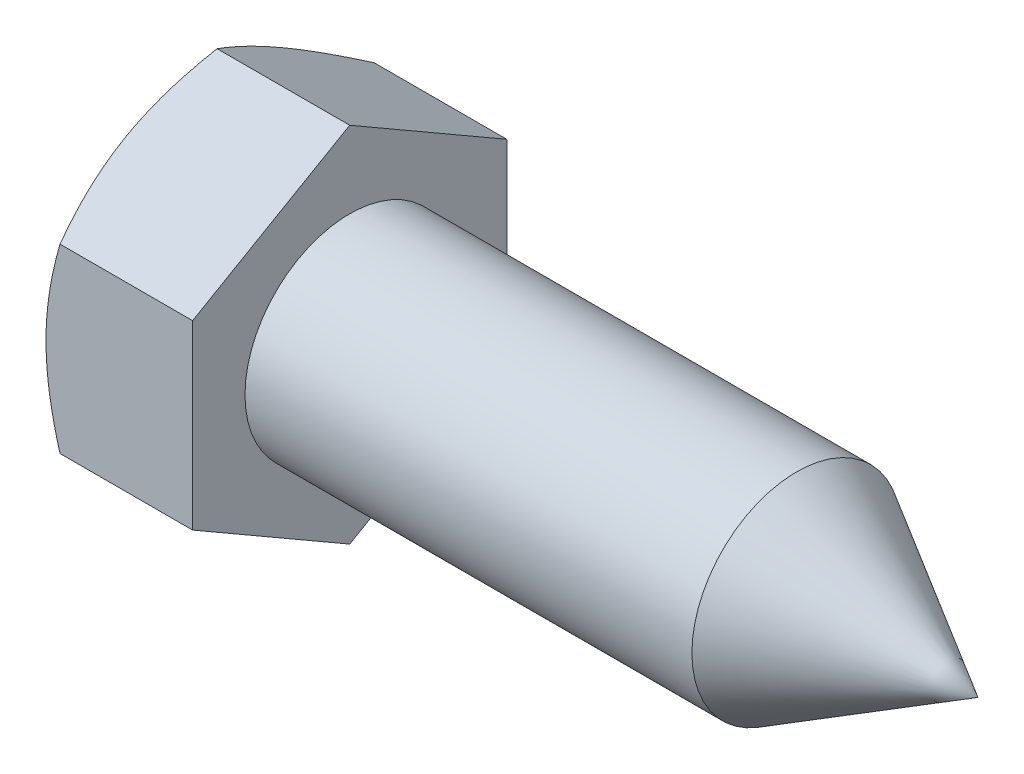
from build123d import *

# Parameters (mm, degrees)
BASEHEAD_DEPTH = 17.78


with BuildPart() as part:
    # Sketch1 → BaseHead (new body)
    with BuildSketch(Plane(origin=(0, 0, 0), x_dir=(0, 0, -1), z_dir=(1, 0, 0))):
        Polygon((19.05, 10.998522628), (19.05, -10.998522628), (0, -21.997045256), (-19.05, -10.998522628), (-19.05, 10.998522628), (0, 21.997045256), align=None)
    extrude(amount=BASEHEAD_DEPTH)

    # Sketch2 → BaseBody (revolve)
    with BuildSketch(Plane.XY, mode=Mode.PRIVATE) as basebody_sk:
        Polygon((0, 0), (93.98, 0), (71.982954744, 12.7), (0, 12.7), align=None)
    revolve(basebody_sk.sketch.rotate(Axis((0, 0, 0), (1, 0, 0)), 90), axis=Axis((0, 0, 0), (1, 0, 0)))

    # Sketch3 → HeadChamfer (revolve, cut)
    with BuildSketch(Plane.XY):
        Polygon((0, 19.05), (5.367651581, 28.347045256), (5.367651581, 34.697045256), (-12.7, 34.697045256), (-12.7, 19.05), align=None)
    revolve(axis=Axis((0, 0, 0), (1, 0, 0)), mode=Mode.SUBTRACT)


solid = part.part
